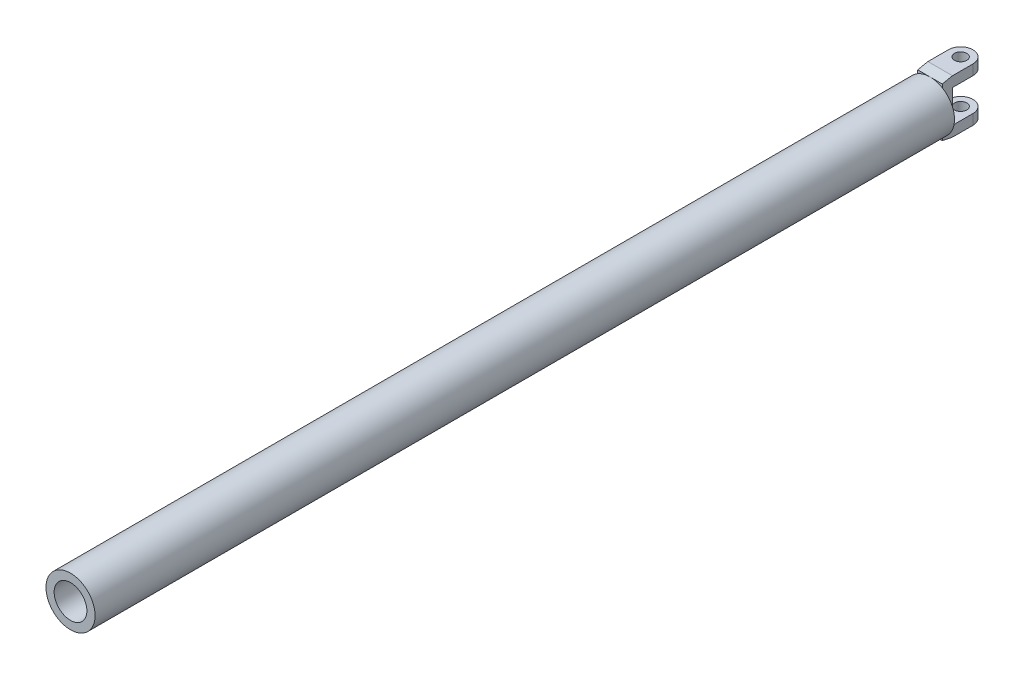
ISO-10303-21;
HEADER;
FILE_DESCRIPTION(('STEP AP214'),'2;1');
FILE_NAME('part.step','',(''),(''),'','','');
FILE_SCHEMA(('AUTOMOTIVE_DESIGN { 1 0 10303 214 1 1 1 1 }'));
ENDSEC;
DATA;
#1=APPLICATION_CONTEXT('core data for automotive mechanical design processes');
#2=APPLICATION_PROTOCOL_DEFINITION('international standard','automotive_design',2000,#1);
#3=PRODUCT_CONTEXT('',#1,'mechanical');
#4=PRODUCT('Part','Part','',(#3));
#5=PRODUCT_RELATED_PRODUCT_CATEGORY('part','',(#4));
#6=PRODUCT_DEFINITION_FORMATION('','',#4);
#7=PRODUCT_DEFINITION_CONTEXT('part definition',#1,'design');
#8=PRODUCT_DEFINITION('design','',#6,#7);
#9=PRODUCT_DEFINITION_SHAPE('','',#8);
#10=(LENGTH_UNIT() NAMED_UNIT(*) SI_UNIT(.MILLI.,.METRE.));
#11=(NAMED_UNIT(*) PLANE_ANGLE_UNIT() SI_UNIT($,.RADIAN.));
#12=(NAMED_UNIT(*) SI_UNIT($,.STERADIAN.) SOLID_ANGLE_UNIT());
#13=UNCERTAINTY_MEASURE_WITH_UNIT(LENGTH_MEASURE(1.E-05),#10,'distance_accuracy_value','');
#14=(GEOMETRIC_REPRESENTATION_CONTEXT(3) GLOBAL_UNCERTAINTY_ASSIGNED_CONTEXT((#13)) GLOBAL_UNIT_ASSIGNED_CONTEXT((#10,
#11,#12)) REPRESENTATION_CONTEXT('',''));
#15=CARTESIAN_POINT('',(0.,0.,0.));
#16=DIRECTION('',(0.,0.,1.));
#17=DIRECTION('',(1.,0.,0.));
#18=AXIS2_PLACEMENT_3D('',#15,#16,#17);
#19=CARTESIAN_POINT('',(0.,0.,0.));
#20=DIRECTION('',(0.,0.,1.));
#21=DIRECTION('',(1.,0.,0.));
#22=AXIS2_PLACEMENT_3D('',#19,#20,#21);
#23=PLANE('',#22);
#24=DIRECTION('',(0.,-1.,0.));
#25=VECTOR('',#24,1.);
#26=CARTESIAN_POINT('',(30.,-60.,0.));
#27=LINE('',#26,#25);
#28=CARTESIAN_POINT('',(30.,51.9615242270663,0.));
#29=VERTEX_POINT('',#28);
#30=CARTESIAN_POINT('',(30.,-51.9615242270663,0.));
#31=VERTEX_POINT('',#30);
#32=EDGE_CURVE('E173',#29,#31,#27,.T.);
#33=ORIENTED_EDGE('',*,*,#32,.F.);
#34=CARTESIAN_POINT('',(0.,0.,0.));
#35=DIRECTION('',(0.,0.,1.));
#36=DIRECTION('',(1.,0.,0.));
#37=AXIS2_PLACEMENT_3D('',#34,#35,#36);
#38=CIRCLE('',#37,60.);
#39=EDGE_CURVE('E188',#31,#29,#38,.T.);
#40=ORIENTED_EDGE('',*,*,#39,.F.);
#41=EDGE_LOOP('',(#33,#40));
#42=FACE_BOUND('',#41,.T.);
#43=ADVANCED_FACE('F41',(#42),#23,.F.);
#44=CARTESIAN_POINT('',(0.,0.,2100.));
#45=DIRECTION('',(0.,0.,-1.));
#46=DIRECTION('',(-1.,0.,0.));
#47=AXIS2_PLACEMENT_3D('',#44,#45,#46);
#48=CYLINDRICAL_SURFACE('',#47,60.);
#49=CARTESIAN_POINT('',(0.,0.,2100.));
#50=DIRECTION('',(0.,0.,1.));
#51=DIRECTION('',(1.,0.,0.));
#52=AXIS2_PLACEMENT_3D('',#49,#50,#51);
#53=CIRCLE('',#52,60.);
#54=CARTESIAN_POINT('',(60.,0.,2100.));
#55=VERTEX_POINT('',#54);
#56=EDGE_CURVE('E197',#55,#55,#53,.T.);
#57=ORIENTED_EDGE('',*,*,#56,.F.);
#58=EDGE_LOOP('',(#57));
#59=FACE_BOUND('',#58,.T.);
#60=CARTESIAN_POINT('',(0.,60.,0.));
#61=VERTEX_POINT('',#60);
#62=EDGE_CURVE('E167',#29,#61,#38,.T.);
#63=ORIENTED_EDGE('',*,*,#62,.T.);
#64=CARTESIAN_POINT('',(-30.,51.9615242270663,0.));
#65=VERTEX_POINT('',#64);
#66=EDGE_CURVE('E200',#61,#65,#38,.T.);
#67=ORIENTED_EDGE('',*,*,#66,.T.);
#68=CARTESIAN_POINT('',(-30.,-51.9615242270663,0.));
#69=VERTEX_POINT('',#68);
#70=EDGE_CURVE('E372',#65,#69,#38,.T.);
#71=ORIENTED_EDGE('',*,*,#70,.T.);
#72=CARTESIAN_POINT('',(0.,-60.,0.));
#73=VERTEX_POINT('',#72);
#74=EDGE_CURVE('E322',#69,#73,#38,.T.);
#75=ORIENTED_EDGE('',*,*,#74,.T.);
#76=EDGE_CURVE('E191',#73,#31,#38,.T.);
#77=ORIENTED_EDGE('',*,*,#76,.T.);
#78=ORIENTED_EDGE('',*,*,#39,.T.);
#79=EDGE_LOOP('',(#63,#67,#71,#75,#77,#78));
#80=FACE_BOUND('',#79,.T.);
#81=ADVANCED_FACE('F373',(#59,#80),#48,.T.);
#82=CARTESIAN_POINT('',(0.,0.,2100.));
#83=DIRECTION('',(0.,0.,1.));
#84=DIRECTION('',(1.,0.,0.));
#85=AXIS2_PLACEMENT_3D('',#82,#83,#84);
#86=PLANE('',#85);
#87=CARTESIAN_POINT('',(0.,0.,2100.));
#88=DIRECTION('',(0.,0.,1.));
#89=DIRECTION('',(1.,0.,0.));
#90=AXIS2_PLACEMENT_3D('',#87,#88,#89);
#91=CIRCLE('',#90,40.);
#92=CARTESIAN_POINT('',(40.,0.,2100.));
#93=VERTEX_POINT('',#92);
#94=EDGE_CURVE('E237',#93,#93,#91,.T.);
#95=ORIENTED_EDGE('',*,*,#94,.F.);
#96=EDGE_LOOP('',(#95));
#97=FACE_BOUND('',#96,.T.);
#98=ORIENTED_EDGE('',*,*,#56,.T.);
#99=EDGE_LOOP('',(#98));
#100=FACE_BOUND('',#99,.T.);
#101=ADVANCED_FACE('F375',(#97,#100),#86,.T.);
#102=ORIENTED_EDGE('',*,*,#70,.F.);
#103=DIRECTION('',(0.,-1.,0.));
#104=VECTOR('',#103,1.);
#105=CARTESIAN_POINT('',(-30.,-60.,0.));
#106=LINE('',#105,#104);
#107=EDGE_CURVE('E204',#65,#69,#106,.T.);
#108=ORIENTED_EDGE('',*,*,#107,.T.);
#109=EDGE_LOOP('',(#102,#108));
#110=FACE_BOUND('',#109,.T.);
#111=ADVANCED_FACE('F382',(#110),#23,.F.);
#112=CARTESIAN_POINT('',(30.,-60.,0.));
#113=DIRECTION('',(0.,0.,-1.));
#114=DIRECTION('',(-1.,0.,0.));
#115=AXIS2_PLACEMENT_3D('',#112,#113,#114);
#116=PLANE('',#115);
#117=ORIENTED_EDGE('',*,*,#62,.F.);
#118=CARTESIAN_POINT('',(30.,60.,0.));
#119=VERTEX_POINT('',#118);
#120=EDGE_CURVE('E162',#119,#29,#27,.T.);
#121=ORIENTED_EDGE('',*,*,#120,.F.);
#122=DIRECTION('',(-1.,0.,0.));
#123=VECTOR('',#122,1.);
#124=CARTESIAN_POINT('',(30.,60.,0.));
#125=LINE('',#124,#123);
#126=EDGE_CURVE('E166',#119,#61,#125,.T.);
#127=ORIENTED_EDGE('',*,*,#126,.T.);
#128=EDGE_LOOP('',(#117,#121,#127));
#129=FACE_BOUND('',#128,.T.);
#130=ADVANCED_FACE('F164',(#129),#116,.F.);
#131=ORIENTED_EDGE('',*,*,#66,.F.);
#132=CARTESIAN_POINT('',(-30.,60.,0.));
#133=VERTEX_POINT('',#132);
#134=EDGE_CURVE('E187',#61,#133,#125,.T.);
#135=ORIENTED_EDGE('',*,*,#134,.T.);
#136=EDGE_CURVE('E271',#133,#65,#106,.T.);
#137=ORIENTED_EDGE('',*,*,#136,.T.);
#138=EDGE_LOOP('',(#131,#135,#137));
#139=FACE_BOUND('',#138,.T.);
#140=ADVANCED_FACE('F369',(#139),#116,.F.);
#141=ORIENTED_EDGE('',*,*,#74,.F.);
#142=CARTESIAN_POINT('',(-30.,-60.,0.));
#143=VERTEX_POINT('',#142);
#144=EDGE_CURVE('E270',#69,#143,#106,.T.);
#145=ORIENTED_EDGE('',*,*,#144,.T.);
#146=DIRECTION('',(-1.,0.,0.));
#147=VECTOR('',#146,1.);
#148=CARTESIAN_POINT('',(30.,-60.,0.));
#149=LINE('',#148,#147);
#150=EDGE_CURVE('E304',#73,#143,#149,.T.);
#151=ORIENTED_EDGE('',*,*,#150,.F.);
#152=EDGE_LOOP('',(#141,#145,#151));
#153=FACE_BOUND('',#152,.T.);
#154=ADVANCED_FACE('F325',(#153),#116,.F.);
#155=CARTESIAN_POINT('',(30.,60.,0.));
#156=DIRECTION('',(0.,-0.98058067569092,-0.196116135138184));
#157=DIRECTION('',(0.,0.196116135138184,-0.98058067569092));
#158=AXIS2_PLACEMENT_3D('',#155,#156,#157);
#159=PLANE('',#158);
#160=DIRECTION('',(0.,-0.196116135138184,0.98058067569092));
#161=VECTOR('',#160,1.);
#162=CARTESIAN_POINT('',(-30.,60.,0.));
#163=LINE('',#162,#161);
#164=CARTESIAN_POINT('',(-30.,65.,-25.));
#165=VERTEX_POINT('',#164);
#166=EDGE_CURVE('E251',#165,#133,#163,.T.);
#167=ORIENTED_EDGE('',*,*,#166,.T.);
#168=ORIENTED_EDGE('',*,*,#134,.F.);
#169=ORIENTED_EDGE('',*,*,#126,.F.);
#170=DIRECTION('',(0.,-0.196116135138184,0.98058067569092));
#171=VECTOR('',#170,1.);
#172=CARTESIAN_POINT('',(30.,60.,0.));
#173=LINE('',#172,#171);
#174=CARTESIAN_POINT('',(30.,65.,-25.));
#175=VERTEX_POINT('',#174);
#176=EDGE_CURVE('E175',#175,#119,#173,.T.);
#177=ORIENTED_EDGE('',*,*,#176,.F.);
#178=DIRECTION('',(-1.,0.,0.));
#179=VECTOR('',#178,1.);
#180=CARTESIAN_POINT('',(30.,65.,-25.));
#181=LINE('',#180,#179);
#182=EDGE_CURVE('E268',#175,#165,#181,.T.);
#183=ORIENTED_EDGE('',*,*,#182,.T.);
#184=EDGE_LOOP('',(#167,#168,#169,#177,#183));
#185=FACE_BOUND('',#184,.T.);
#186=ADVANCED_FACE('F186',(#185),#159,.F.);
#187=ORIENTED_EDGE('',*,*,#76,.F.);
#188=CARTESIAN_POINT('',(30.,-60.,0.));
#189=VERTEX_POINT('',#188);
#190=EDGE_CURVE('E193',#189,#73,#149,.T.);
#191=ORIENTED_EDGE('',*,*,#190,.F.);
#192=EDGE_CURVE('E171',#31,#189,#27,.T.);
#193=ORIENTED_EDGE('',*,*,#192,.F.);
#194=EDGE_LOOP('',(#187,#191,#193));
#195=FACE_BOUND('',#194,.T.);
#196=ADVANCED_FACE('F319',(#195),#116,.F.);
#197=CARTESIAN_POINT('',(30.,-60.,0.));
#198=DIRECTION('',(0.,0.98058067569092,-0.196116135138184));
#199=DIRECTION('',(0.,0.196116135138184,0.98058067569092));
#200=AXIS2_PLACEMENT_3D('',#197,#198,#199);
#201=PLANE('',#200);
#202=DIRECTION('',(0.,-0.196116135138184,-0.98058067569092));
#203=VECTOR('',#202,1.);
#204=CARTESIAN_POINT('',(-30.,-60.,0.));
#205=LINE('',#204,#203);
#206=CARTESIAN_POINT('',(-30.,-65.,-25.));
#207=VERTEX_POINT('',#206);
#208=EDGE_CURVE('E274',#143,#207,#205,.T.);
#209=ORIENTED_EDGE('',*,*,#208,.T.);
#210=DIRECTION('',(-1.,0.,0.));
#211=VECTOR('',#210,1.);
#212=CARTESIAN_POINT('',(30.,-65.,-25.));
#213=LINE('',#212,#211);
#214=CARTESIAN_POINT('',(30.,-65.,-25.));
#215=VERTEX_POINT('',#214);
#216=EDGE_CURVE('E302',#215,#207,#213,.T.);
#217=ORIENTED_EDGE('',*,*,#216,.F.);
#218=DIRECTION('',(0.,-0.196116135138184,-0.98058067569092));
#219=VECTOR('',#218,1.);
#220=CARTESIAN_POINT('',(30.,-60.,0.));
#221=LINE('',#220,#219);
#222=EDGE_CURVE('E170',#189,#215,#221,.T.);
#223=ORIENTED_EDGE('',*,*,#222,.F.);
#224=ORIENTED_EDGE('',*,*,#190,.T.);
#225=ORIENTED_EDGE('',*,*,#150,.T.);
#226=EDGE_LOOP('',(#209,#217,#223,#224,#225));
#227=FACE_BOUND('',#226,.T.);
#228=ADVANCED_FACE('F315',(#227),#201,.F.);
#229=CARTESIAN_POINT('',(30.,-65.,-25.));
#230=DIRECTION('',(0.,1.,0.));
#231=DIRECTION('',(0.,0.,1.));
#232=AXIS2_PLACEMENT_3D('',#229,#230,#231);
#233=PLANE('',#232);
#234=CARTESIAN_POINT('',(0.,-65.,-75.));
#235=DIRECTION('',(0.,1.,0.));
#236=DIRECTION('',(0.,0.,1.));
#237=AXIS2_PLACEMENT_3D('',#234,#235,#236);
#238=CIRCLE('',#237,15.);
#239=CARTESIAN_POINT('',(0.,-65.,-60.));
#240=VERTEX_POINT('',#239);
#241=EDGE_CURVE('E230',#240,#240,#238,.T.);
#242=ORIENTED_EDGE('',*,*,#241,.T.);
#243=EDGE_LOOP('',(#242));
#244=FACE_BOUND('',#243,.T.);
#245=DIRECTION('',(0.,0.,-1.));
#246=VECTOR('',#245,1.);
#247=CARTESIAN_POINT('',(-30.,-65.,-25.));
#248=LINE('',#247,#246);
#249=CARTESIAN_POINT('',(-30.,-65.,-75.));
#250=VERTEX_POINT('',#249);
#251=EDGE_CURVE('E276',#207,#250,#248,.T.);
#252=ORIENTED_EDGE('',*,*,#251,.T.);
#253=CARTESIAN_POINT('',(0.,-65.,-75.));
#254=DIRECTION('',(0.,1.,0.));
#255=DIRECTION('',(0.,0.,1.));
#256=AXIS2_PLACEMENT_3D('',#253,#254,#255);
#257=CIRCLE('',#256,30.);
#258=CARTESIAN_POINT('',(0.,-65.,-105.));
#259=VERTEX_POINT('',#258);
#260=EDGE_CURVE('E214',#250,#259,#257,.F.);
#261=ORIENTED_EDGE('',*,*,#260,.T.);
#262=CARTESIAN_POINT('',(0.,-65.,-75.));
#263=DIRECTION('',(0.,1.,0.));
#264=DIRECTION('',(0.,0.,1.));
#265=AXIS2_PLACEMENT_3D('',#262,#263,#264);
#266=CIRCLE('',#265,30.);
#267=CARTESIAN_POINT('',(30.,-65.,-75.));
#268=VERTEX_POINT('',#267);
#269=EDGE_CURVE('E212',#259,#268,#266,.F.);
#270=ORIENTED_EDGE('',*,*,#269,.T.);
#271=DIRECTION('',(0.,0.,-1.));
#272=VECTOR('',#271,1.);
#273=CARTESIAN_POINT('',(30.,-65.,-25.));
#274=LINE('',#273,#272);
#275=EDGE_CURVE('E254',#215,#268,#274,.T.);
#276=ORIENTED_EDGE('',*,*,#275,.F.);
#277=ORIENTED_EDGE('',*,*,#216,.T.);
#278=EDGE_LOOP('',(#252,#261,#270,#276,#277));
#279=FACE_BOUND('',#278,.T.);
#280=ADVANCED_FACE('F332',(#244,#279),#233,.F.);
#281=CARTESIAN_POINT('',(30.,-40.,-105.));
#282=DIRECTION('',(0.,-1.,0.));
#283=DIRECTION('',(0.,0.,-1.));
#284=AXIS2_PLACEMENT_3D('',#281,#282,#283);
#285=PLANE('',#284);
#286=CARTESIAN_POINT('',(0.,-40.,-75.));
#287=DIRECTION('',(0.,-1.,0.));
#288=DIRECTION('',(0.,0.,-1.));
#289=AXIS2_PLACEMENT_3D('',#286,#287,#288);
#290=CIRCLE('',#289,15.);
#291=CARTESIAN_POINT('',(0.,-40.,-90.));
#292=VERTEX_POINT('',#291);
#293=EDGE_CURVE('E249',#292,#292,#290,.T.);
#294=ORIENTED_EDGE('',*,*,#293,.T.);
#295=EDGE_LOOP('',(#294));
#296=FACE_BOUND('',#295,.T.);
#297=CARTESIAN_POINT('',(0.,-40.,-75.));
#298=DIRECTION('',(0.,-1.,0.));
#299=DIRECTION('',(0.,0.,-1.));
#300=AXIS2_PLACEMENT_3D('',#297,#298,#299);
#301=CIRCLE('',#300,30.);
#302=CARTESIAN_POINT('',(30.,-40.,-75.));
#303=VERTEX_POINT('',#302);
#304=CARTESIAN_POINT('',(0.,-40.,-105.));
#305=VERTEX_POINT('',#304);
#306=EDGE_CURVE('E201',#303,#305,#301,.F.);
#307=ORIENTED_EDGE('',*,*,#306,.T.);
#308=CARTESIAN_POINT('',(0.,-40.,-75.));
#309=DIRECTION('',(0.,-1.,0.));
#310=DIRECTION('',(0.,0.,-1.));
#311=AXIS2_PLACEMENT_3D('',#308,#309,#310);
#312=CIRCLE('',#311,30.);
#313=CARTESIAN_POINT('',(-30.,-40.,-75.));
#314=VERTEX_POINT('',#313);
#315=EDGE_CURVE('E203',#305,#314,#312,.F.);
#316=ORIENTED_EDGE('',*,*,#315,.T.);
#317=DIRECTION('',(0.,0.,1.));
#318=VECTOR('',#317,1.);
#319=CARTESIAN_POINT('',(-30.,-40.,-105.));
#320=LINE('',#319,#318);
#321=CARTESIAN_POINT('',(-30.,-40.,-27.4754878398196));
#322=VERTEX_POINT('',#321);
#323=EDGE_CURVE('E279',#314,#322,#320,.T.);
#324=ORIENTED_EDGE('',*,*,#323,.T.);
#325=DIRECTION('',(-1.,0.,0.));
#326=VECTOR('',#325,1.);
#327=CARTESIAN_POINT('',(30.,-40.,-27.4754878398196));
#328=LINE('',#327,#326);
#329=CARTESIAN_POINT('',(30.,-40.,-27.4754878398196));
#330=VERTEX_POINT('',#329);
#331=EDGE_CURVE('E300',#330,#322,#328,.T.);
#332=ORIENTED_EDGE('',*,*,#331,.F.);
#333=DIRECTION('',(0.,0.,1.));
#334=VECTOR('',#333,1.);
#335=CARTESIAN_POINT('',(30.,-40.,-105.));
#336=LINE('',#335,#334);
#337=EDGE_CURVE('E256',#303,#330,#336,.T.);
#338=ORIENTED_EDGE('',*,*,#337,.F.);
#339=EDGE_LOOP('',(#307,#316,#324,#332,#338));
#340=FACE_BOUND('',#339,.T.);
#341=ADVANCED_FACE('F340',(#296,#340),#285,.F.);
#342=CARTESIAN_POINT('',(30.,-40.,-27.4754878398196));
#343=DIRECTION('',(0.,-0.98058067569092,0.196116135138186));
#344=DIRECTION('',(0.,-0.196116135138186,-0.98058067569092));
#345=AXIS2_PLACEMENT_3D('',#342,#343,#344);
#346=PLANE('',#345);
#347=DIRECTION('',(0.,0.196116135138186,0.98058067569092));
#348=VECTOR('',#347,1.);
#349=CARTESIAN_POINT('',(-30.,-40.,-27.4754878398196));
#350=LINE('',#349,#348);
#351=CARTESIAN_POINT('',(-30.,-39.5049024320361,-25.));
#352=VERTEX_POINT('',#351);
#353=EDGE_CURVE('E281',#322,#352,#350,.T.);
#354=ORIENTED_EDGE('',*,*,#353,.T.);
#355=DIRECTION('',(-1.,0.,0.));
#356=VECTOR('',#355,1.);
#357=CARTESIAN_POINT('',(30.,-39.5049024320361,-25.));
#358=LINE('',#357,#356);
#359=CARTESIAN_POINT('',(30.,-39.5049024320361,-25.));
#360=VERTEX_POINT('',#359);
#361=EDGE_CURVE('E297',#360,#352,#358,.T.);
#362=ORIENTED_EDGE('',*,*,#361,.F.);
#363=DIRECTION('',(0.,0.196116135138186,0.98058067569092));
#364=VECTOR('',#363,1.);
#365=CARTESIAN_POINT('',(30.,-40.,-27.4754878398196));
#366=LINE('',#365,#364);
#367=EDGE_CURVE('E258',#330,#360,#366,.T.);
#368=ORIENTED_EDGE('',*,*,#367,.F.);
#369=ORIENTED_EDGE('',*,*,#331,.T.);
#370=EDGE_LOOP('',(#354,#362,#368,#369));
#371=FACE_BOUND('',#370,.T.);
#372=ADVANCED_FACE('F347',(#371),#346,.F.);
#373=CARTESIAN_POINT('',(30.,39.5049024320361,-25.));
#374=DIRECTION('',(0.,0.,1.));
#375=DIRECTION('',(1.,0.,0.));
#376=AXIS2_PLACEMENT_3D('',#373,#374,#375);
#377=PLANE('',#376);
#378=DIRECTION('',(0.,1.,0.));
#379=VECTOR('',#378,1.);
#380=CARTESIAN_POINT('',(-30.,39.5049024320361,-25.));
#381=LINE('',#380,#379);
#382=CARTESIAN_POINT('',(-30.,39.5049024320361,-25.));
#383=VERTEX_POINT('',#382);
#384=EDGE_CURVE('E283',#352,#383,#381,.T.);
#385=ORIENTED_EDGE('',*,*,#384,.T.);
#386=DIRECTION('',(-1.,0.,0.));
#387=VECTOR('',#386,1.);
#388=CARTESIAN_POINT('',(30.,39.5049024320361,-25.));
#389=LINE('',#388,#387);
#390=CARTESIAN_POINT('',(30.,39.5049024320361,-25.));
#391=VERTEX_POINT('',#390);
#392=EDGE_CURVE('E294',#391,#383,#389,.T.);
#393=ORIENTED_EDGE('',*,*,#392,.F.);
#394=DIRECTION('',(0.,1.,0.));
#395=VECTOR('',#394,1.);
#396=CARTESIAN_POINT('',(30.,39.5049024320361,-25.));
#397=LINE('',#396,#395);
#398=EDGE_CURVE('E260',#360,#391,#397,.T.);
#399=ORIENTED_EDGE('',*,*,#398,.F.);
#400=ORIENTED_EDGE('',*,*,#361,.T.);
#401=EDGE_LOOP('',(#385,#393,#399,#400));
#402=FACE_BOUND('',#401,.T.);
#403=ADVANCED_FACE('F351',(#402),#377,.F.);
#404=CARTESIAN_POINT('',(30.,40.,-27.4754878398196));
#405=DIRECTION('',(0.,0.98058067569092,0.196116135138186));
#406=DIRECTION('',(0.,-0.196116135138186,0.98058067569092));
#407=AXIS2_PLACEMENT_3D('',#404,#405,#406);
#408=PLANE('',#407);
#409=DIRECTION('',(0.,0.196116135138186,-0.98058067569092));
#410=VECTOR('',#409,1.);
#411=CARTESIAN_POINT('',(-30.,40.,-27.4754878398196));
#412=LINE('',#411,#410);
#413=CARTESIAN_POINT('',(-30.,40.,-27.4754878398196));
#414=VERTEX_POINT('',#413);
#415=EDGE_CURVE('E285',#383,#414,#412,.T.);
#416=ORIENTED_EDGE('',*,*,#415,.T.);
#417=DIRECTION('',(-1.,0.,0.));
#418=VECTOR('',#417,1.);
#419=CARTESIAN_POINT('',(30.,40.,-27.4754878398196));
#420=LINE('',#419,#418);
#421=CARTESIAN_POINT('',(30.,40.,-27.4754878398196));
#422=VERTEX_POINT('',#421);
#423=EDGE_CURVE('E291',#422,#414,#420,.T.);
#424=ORIENTED_EDGE('',*,*,#423,.F.);
#425=DIRECTION('',(0.,0.196116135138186,-0.98058067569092));
#426=VECTOR('',#425,1.);
#427=CARTESIAN_POINT('',(30.,40.,-27.4754878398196));
#428=LINE('',#427,#426);
#429=EDGE_CURVE('E262',#391,#422,#428,.T.);
#430=ORIENTED_EDGE('',*,*,#429,.F.);
#431=ORIENTED_EDGE('',*,*,#392,.T.);
#432=EDGE_LOOP('',(#416,#424,#430,#431));
#433=FACE_BOUND('',#432,.T.);
#434=ADVANCED_FACE('F356',(#433),#408,.F.);
#435=CARTESIAN_POINT('',(30.,40.,-105.));
#436=DIRECTION('',(0.,1.,0.));
#437=DIRECTION('',(0.,0.,1.));
#438=AXIS2_PLACEMENT_3D('',#435,#436,#437);
#439=PLANE('',#438);
#440=CARTESIAN_POINT('',(0.,40.,-75.));
#441=DIRECTION('',(0.,1.,0.));
#442=DIRECTION('',(0.,0.,1.));
#443=AXIS2_PLACEMENT_3D('',#440,#441,#442);
#444=CIRCLE('',#443,15.);
#445=CARTESIAN_POINT('',(0.,40.,-60.));
#446=VERTEX_POINT('',#445);
#447=EDGE_CURVE('E246',#446,#446,#444,.T.);
#448=ORIENTED_EDGE('',*,*,#447,.T.);
#449=EDGE_LOOP('',(#448));
#450=FACE_BOUND('',#449,.T.);
#451=DIRECTION('',(0.,0.,-1.));
#452=VECTOR('',#451,1.);
#453=CARTESIAN_POINT('',(-30.,40.,-105.));
#454=LINE('',#453,#452);
#455=CARTESIAN_POINT('',(-30.,40.,-75.));
#456=VERTEX_POINT('',#455);
#457=EDGE_CURVE('E287',#414,#456,#454,.T.);
#458=ORIENTED_EDGE('',*,*,#457,.T.);
#459=CARTESIAN_POINT('',(0.,40.,-75.));
#460=DIRECTION('',(0.,1.,0.));
#461=DIRECTION('',(0.,0.,1.));
#462=AXIS2_PLACEMENT_3D('',#459,#460,#461);
#463=CIRCLE('',#462,30.);
#464=CARTESIAN_POINT('',(0.,40.,-105.));
#465=VERTEX_POINT('',#464);
#466=EDGE_CURVE('E11',#456,#465,#463,.F.);
#467=ORIENTED_EDGE('',*,*,#466,.T.);
#468=CARTESIAN_POINT('',(0.,40.,-75.));
#469=DIRECTION('',(0.,1.,0.));
#470=DIRECTION('',(0.,0.,1.));
#471=AXIS2_PLACEMENT_3D('',#468,#469,#470);
#472=CIRCLE('',#471,30.);
#473=CARTESIAN_POINT('',(30.,40.,-75.));
#474=VERTEX_POINT('',#473);
#475=EDGE_CURVE('E50',#465,#474,#472,.F.);
#476=ORIENTED_EDGE('',*,*,#475,.T.);
#477=DIRECTION('',(0.,0.,-1.));
#478=VECTOR('',#477,1.);
#479=CARTESIAN_POINT('',(30.,40.,-105.));
#480=LINE('',#479,#478);
#481=EDGE_CURVE('E264',#422,#474,#480,.T.);
#482=ORIENTED_EDGE('',*,*,#481,.F.);
#483=ORIENTED_EDGE('',*,*,#423,.T.);
#484=EDGE_LOOP('',(#458,#467,#476,#482,#483));
#485=FACE_BOUND('',#484,.T.);
#486=ADVANCED_FACE('F447',(#450,#485),#439,.F.);
#487=CARTESIAN_POINT('',(30.,65.,-25.));
#488=DIRECTION('',(0.,-1.,0.));
#489=DIRECTION('',(0.,0.,-1.));
#490=AXIS2_PLACEMENT_3D('',#487,#488,#489);
#491=PLANE('',#490);
#492=CARTESIAN_POINT('',(0.,65.,-75.));
#493=DIRECTION('',(0.,1.,0.));
#494=DIRECTION('',(0.,0.,1.));
#495=AXIS2_PLACEMENT_3D('',#492,#493,#494);
#496=CIRCLE('',#495,15.);
#497=CARTESIAN_POINT('',(0.,65.,-60.));
#498=VERTEX_POINT('',#497);
#499=EDGE_CURVE('E225',#498,#498,#496,.T.);
#500=ORIENTED_EDGE('',*,*,#499,.F.);
#501=EDGE_LOOP('',(#500));
#502=FACE_BOUND('',#501,.T.);
#503=CARTESIAN_POINT('',(0.,65.,-75.));
#504=DIRECTION('',(0.,-1.,0.));
#505=DIRECTION('',(0.,0.,-1.));
#506=AXIS2_PLACEMENT_3D('',#503,#504,#505);
#507=CIRCLE('',#506,30.);
#508=CARTESIAN_POINT('',(30.,65.,-75.));
#509=VERTEX_POINT('',#508);
#510=CARTESIAN_POINT('',(0.,65.,-105.));
#511=VERTEX_POINT('',#510);
#512=EDGE_CURVE('E64',#509,#511,#507,.F.);
#513=ORIENTED_EDGE('',*,*,#512,.T.);
#514=CARTESIAN_POINT('',(0.,65.,-75.));
#515=DIRECTION('',(0.,-1.,0.));
#516=DIRECTION('',(0.,0.,-1.));
#517=AXIS2_PLACEMENT_3D('',#514,#515,#516);
#518=CIRCLE('',#517,30.);
#519=CARTESIAN_POINT('',(-30.,65.,-75.));
#520=VERTEX_POINT('',#519);
#521=EDGE_CURVE('E221',#511,#520,#518,.F.);
#522=ORIENTED_EDGE('',*,*,#521,.T.);
#523=DIRECTION('',(0.,0.,1.));
#524=VECTOR('',#523,1.);
#525=CARTESIAN_POINT('',(-30.,65.,-25.));
#526=LINE('',#525,#524);
#527=EDGE_CURVE('E182',#520,#165,#526,.T.);
#528=ORIENTED_EDGE('',*,*,#527,.T.);
#529=ORIENTED_EDGE('',*,*,#182,.F.);
#530=DIRECTION('',(0.,0.,1.));
#531=VECTOR('',#530,1.);
#532=CARTESIAN_POINT('',(30.,65.,-25.));
#533=LINE('',#532,#531);
#534=EDGE_CURVE('E178',#509,#175,#533,.T.);
#535=ORIENTED_EDGE('',*,*,#534,.F.);
#536=EDGE_LOOP('',(#513,#522,#528,#529,#535));
#537=FACE_BOUND('',#536,.T.);
#538=ADVANCED_FACE('F363',(#502,#537),#491,.F.);
#539=CARTESIAN_POINT('',(30.,0.,0.));
#540=DIRECTION('',(-1.,0.,0.));
#541=DIRECTION('',(0.,0.,1.));
#542=AXIS2_PLACEMENT_3D('',#539,#540,#541);
#543=PLANE('',#542);
#544=ORIENTED_EDGE('',*,*,#275,.T.);
#545=DIRECTION('',(0.,1.,0.));
#546=VECTOR('',#545,1.);
#547=CARTESIAN_POINT('',(30.,0.,-75.));
#548=LINE('',#547,#546);
#549=EDGE_CURVE('E218',#268,#303,#548,.T.);
#550=ORIENTED_EDGE('',*,*,#549,.T.);
#551=ORIENTED_EDGE('',*,*,#337,.T.);
#552=ORIENTED_EDGE('',*,*,#367,.T.);
#553=ORIENTED_EDGE('',*,*,#398,.T.);
#554=ORIENTED_EDGE('',*,*,#429,.T.);
#555=ORIENTED_EDGE('',*,*,#481,.T.);
#556=DIRECTION('',(0.,1.,0.));
#557=VECTOR('',#556,1.);
#558=CARTESIAN_POINT('',(30.,0.,-75.));
#559=LINE('',#558,#557);
#560=EDGE_CURVE('E216',#474,#509,#559,.T.);
#561=ORIENTED_EDGE('',*,*,#560,.T.);
#562=ORIENTED_EDGE('',*,*,#534,.T.);
#563=ORIENTED_EDGE('',*,*,#176,.T.);
#564=ORIENTED_EDGE('',*,*,#120,.T.);
#565=ORIENTED_EDGE('',*,*,#32,.T.);
#566=ORIENTED_EDGE('',*,*,#192,.T.);
#567=ORIENTED_EDGE('',*,*,#222,.T.);
#568=EDGE_LOOP('',(#544,#550,#551,#552,#553,#554,#555,#561,#562,#563,#564,#565,#566,#567));
#569=FACE_BOUND('',#568,.T.);
#570=ADVANCED_FACE('F177',(#569),#543,.F.);
#571=CARTESIAN_POINT('',(-30.,0.,0.));
#572=DIRECTION('',(-1.,0.,0.));
#573=DIRECTION('',(0.,0.,1.));
#574=AXIS2_PLACEMENT_3D('',#571,#572,#573);
#575=PLANE('',#574);
#576=ORIENTED_EDGE('',*,*,#323,.F.);
#577=DIRECTION('',(0.,1.,0.));
#578=VECTOR('',#577,1.);
#579=CARTESIAN_POINT('',(-30.,-65.,-75.));
#580=LINE('',#579,#578);
#581=EDGE_CURVE('E209',#314,#250,#580,.F.);
#582=ORIENTED_EDGE('',*,*,#581,.T.);
#583=ORIENTED_EDGE('',*,*,#251,.F.);
#584=ORIENTED_EDGE('',*,*,#208,.F.);
#585=ORIENTED_EDGE('',*,*,#144,.F.);
#586=ORIENTED_EDGE('',*,*,#107,.F.);
#587=ORIENTED_EDGE('',*,*,#136,.F.);
#588=ORIENTED_EDGE('',*,*,#166,.F.);
#589=ORIENTED_EDGE('',*,*,#527,.F.);
#590=DIRECTION('',(0.,1.,0.));
#591=VECTOR('',#590,1.);
#592=CARTESIAN_POINT('',(-30.,40.,-75.));
#593=LINE('',#592,#591);
#594=EDGE_CURVE('E206',#520,#456,#593,.F.);
#595=ORIENTED_EDGE('',*,*,#594,.T.);
#596=ORIENTED_EDGE('',*,*,#457,.F.);
#597=ORIENTED_EDGE('',*,*,#415,.F.);
#598=ORIENTED_EDGE('',*,*,#384,.F.);
#599=ORIENTED_EDGE('',*,*,#353,.F.);
#600=EDGE_LOOP('',(#576,#582,#583,#584,#585,#586,#587,#588,#589,#595,#596,#597,#598,#599));
#601=FACE_BOUND('',#600,.T.);
#602=ADVANCED_FACE('F331',(#601),#575,.T.);
#603=CARTESIAN_POINT('',(0.,-65.,-75.));
#604=DIRECTION('',(0.,1.,0.));
#605=DIRECTION('',(0.,0.,1.));
#606=AXIS2_PLACEMENT_3D('',#603,#604,#605);
#607=CYLINDRICAL_SURFACE('',#606,15.);
#608=ORIENTED_EDGE('',*,*,#499,.T.);
#609=EDGE_LOOP('',(#608));
#610=FACE_BOUND('',#609,.T.);
#611=ORIENTED_EDGE('',*,*,#447,.F.);
#612=EDGE_LOOP('',(#611));
#613=FACE_BOUND('',#612,.T.);
#614=ADVANCED_FACE('F420',(#610,#613),#607,.F.);
#615=ORIENTED_EDGE('',*,*,#241,.F.);
#616=EDGE_LOOP('',(#615));
#617=FACE_BOUND('',#616,.T.);
#618=ORIENTED_EDGE('',*,*,#293,.F.);
#619=EDGE_LOOP('',(#618));
#620=FACE_BOUND('',#619,.T.);
#621=ADVANCED_FACE('F393',(#617,#620),#607,.F.);
#622=CARTESIAN_POINT('',(0.,0.,-75.));
#623=DIRECTION('',(0.,1.,0.));
#624=DIRECTION('',(0.,0.,1.));
#625=AXIS2_PLACEMENT_3D('',#622,#623,#624);
#626=CYLINDRICAL_SURFACE('',#625,30.);
#627=ORIENTED_EDGE('',*,*,#549,.F.);
#628=ORIENTED_EDGE('',*,*,#269,.F.);
#629=DIRECTION('',(0.,1.,0.));
#630=VECTOR('',#629,1.);
#631=CARTESIAN_POINT('',(0.,-65.,-105.));
#632=LINE('',#631,#630);
#633=EDGE_CURVE('E223',#305,#259,#632,.F.);
#634=ORIENTED_EDGE('',*,*,#633,.F.);
#635=ORIENTED_EDGE('',*,*,#306,.F.);
#636=EDGE_LOOP('',(#627,#628,#634,#635));
#637=FACE_BOUND('',#636,.T.);
#638=ADVANCED_FACE('F338',(#637),#626,.T.);
#639=CARTESIAN_POINT('',(0.,-65.,-75.));
#640=DIRECTION('',(0.,-1.,0.));
#641=DIRECTION('',(0.,0.,-1.));
#642=AXIS2_PLACEMENT_3D('',#639,#640,#641);
#643=CYLINDRICAL_SURFACE('',#642,30.);
#644=ORIENTED_EDGE('',*,*,#260,.F.);
#645=ORIENTED_EDGE('',*,*,#581,.F.);
#646=ORIENTED_EDGE('',*,*,#315,.F.);
#647=ORIENTED_EDGE('',*,*,#633,.T.);
#648=EDGE_LOOP('',(#644,#645,#646,#647));
#649=FACE_BOUND('',#648,.T.);
#650=ADVANCED_FACE('F389',(#649),#643,.T.);
#651=CARTESIAN_POINT('',(0.,0.,-75.));
#652=DIRECTION('',(0.,1.,0.));
#653=DIRECTION('',(0.,0.,1.));
#654=AXIS2_PLACEMENT_3D('',#651,#652,#653);
#655=CYLINDRICAL_SURFACE('',#654,30.);
#656=ORIENTED_EDGE('',*,*,#560,.F.);
#657=ORIENTED_EDGE('',*,*,#475,.F.);
#658=DIRECTION('',(0.,1.,0.));
#659=VECTOR('',#658,1.);
#660=CARTESIAN_POINT('',(0.,65.,-105.));
#661=LINE('',#660,#659);
#662=EDGE_CURVE('E45',#511,#465,#661,.F.);
#663=ORIENTED_EDGE('',*,*,#662,.F.);
#664=ORIENTED_EDGE('',*,*,#512,.F.);
#665=EDGE_LOOP('',(#656,#657,#663,#664));
#666=FACE_BOUND('',#665,.T.);
#667=ADVANCED_FACE('F43',(#666),#655,.T.);
#668=CARTESIAN_POINT('',(0.,65.,-75.));
#669=DIRECTION('',(0.,-1.,0.));
#670=DIRECTION('',(0.,0.,-1.));
#671=AXIS2_PLACEMENT_3D('',#668,#669,#670);
#672=CYLINDRICAL_SURFACE('',#671,30.);
#673=ORIENTED_EDGE('',*,*,#466,.F.);
#674=ORIENTED_EDGE('',*,*,#594,.F.);
#675=ORIENTED_EDGE('',*,*,#521,.F.);
#676=ORIENTED_EDGE('',*,*,#662,.T.);
#677=EDGE_LOOP('',(#673,#674,#675,#676));
#678=FACE_BOUND('',#677,.T.);
#679=ADVANCED_FACE('F361',(#678),#672,.T.);
#680=CARTESIAN_POINT('',(0.,0.,1600.));
#681=DIRECTION('',(0.,0.,1.));
#682=DIRECTION('',(1.,0.,0.));
#683=AXIS2_PLACEMENT_3D('',#680,#681,#682);
#684=CYLINDRICAL_SURFACE('',#683,40.);
#685=CARTESIAN_POINT('',(0.,0.,1600.));
#686=DIRECTION('',(0.,0.,1.));
#687=DIRECTION('',(1.,0.,0.));
#688=AXIS2_PLACEMENT_3D('',#685,#686,#687);
#689=CIRCLE('',#688,40.);
#690=CARTESIAN_POINT('',(40.,0.,1600.));
#691=VERTEX_POINT('',#690);
#692=EDGE_CURVE('E233',#691,#691,#689,.T.);
#693=ORIENTED_EDGE('',*,*,#692,.F.);
#694=EDGE_LOOP('',(#693));
#695=FACE_BOUND('',#694,.T.);
#696=ORIENTED_EDGE('',*,*,#94,.T.);
#697=EDGE_LOOP('',(#696));
#698=FACE_BOUND('',#697,.T.);
#699=ADVANCED_FACE('F395',(#695,#698),#684,.F.);
#700=CARTESIAN_POINT('',(0.,0.,1600.));
#701=DIRECTION('',(0.,0.,1.));
#702=DIRECTION('',(1.,0.,0.));
#703=AXIS2_PLACEMENT_3D('',#700,#701,#702);
#704=PLANE('',#703);
#705=ORIENTED_EDGE('',*,*,#692,.T.);
#706=EDGE_LOOP('',(#705));
#707=FACE_BOUND('',#706,.T.);
#708=ADVANCED_FACE('F400',(#707),#704,.T.);
#709=CLOSED_SHELL('',(#43,#81,#101,#111,#130,#140,#154,#186,#196,#228,#280,#341,#372,#403,#434,
#486,#538,#570,#602,#614,#621,#638,#650,#667,#679,#699,#708));
#710=MANIFOLD_SOLID_BREP('B2',#709);
#711=ADVANCED_BREP_SHAPE_REPRESENTATION('',(#18,#710),#14);
#712=SHAPE_DEFINITION_REPRESENTATION(#9,#711);
ENDSEC;
END-ISO-10303-21;
